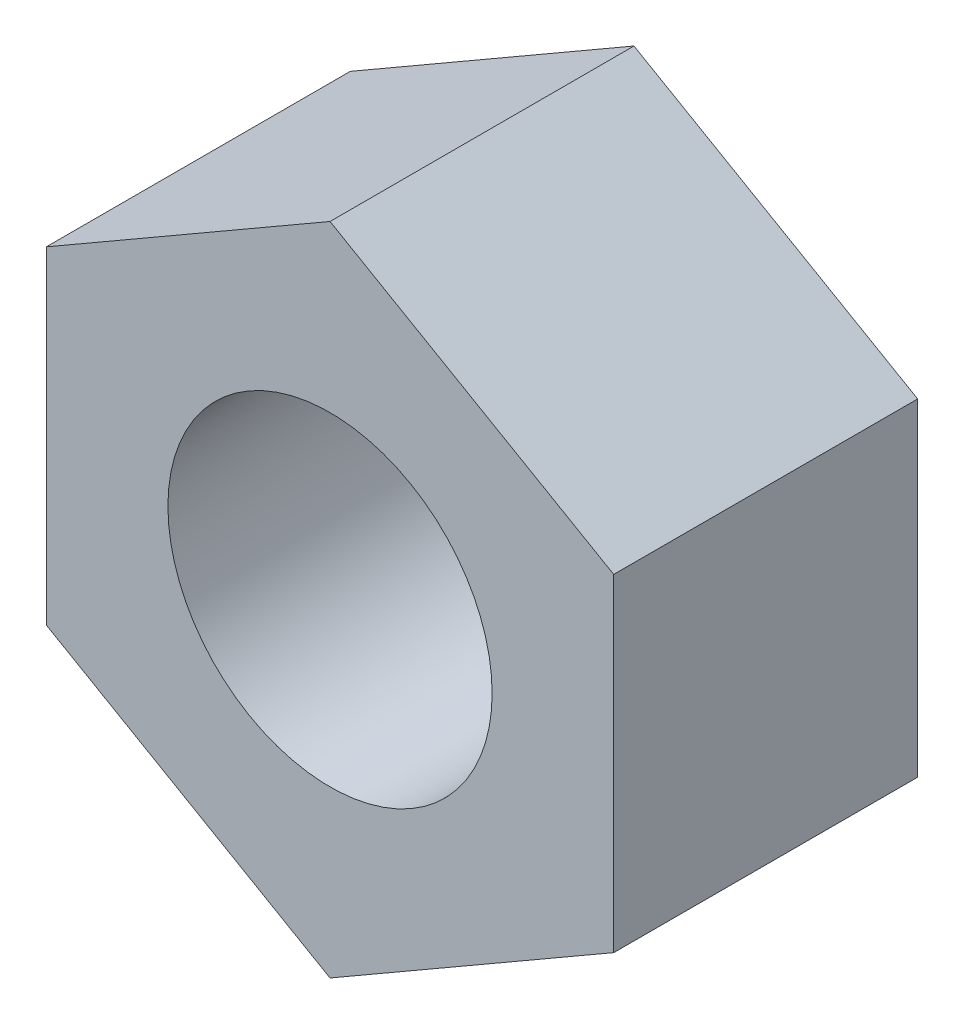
from build123d import *

# Parameters (mm, degrees)
BOSS_EXTRUDE1_DEPTH = 15
SKETCH2_R           = 8
CUT_EXTRUDE1_DEPTH  = 27.121510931


with BuildPart() as part:
    # Sketch1 → Boss-Extrude1 (new body)
    with BuildSketch(Plane.XY):
        Polygon((14, 8.082903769), (0, 16.165807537), (-14, 8.082903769), (-14, -8.082903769), (0, -16.165807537), (14, -8.082903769), align=None)
    extrude(amount=BOSS_EXTRUDE1_DEPTH)

    # Sketch2 → Cut-Extrude1 (cut, through all)
    with BuildSketch(Plane(origin=(0, 0, 0), x_dir=(-1, 0, 0), z_dir=(0, 0, -1))):
        Circle(SKETCH2_R)
    extrude(amount=-CUT_EXTRUDE1_DEPTH, mode=Mode.SUBTRACT)


solid = part.part
